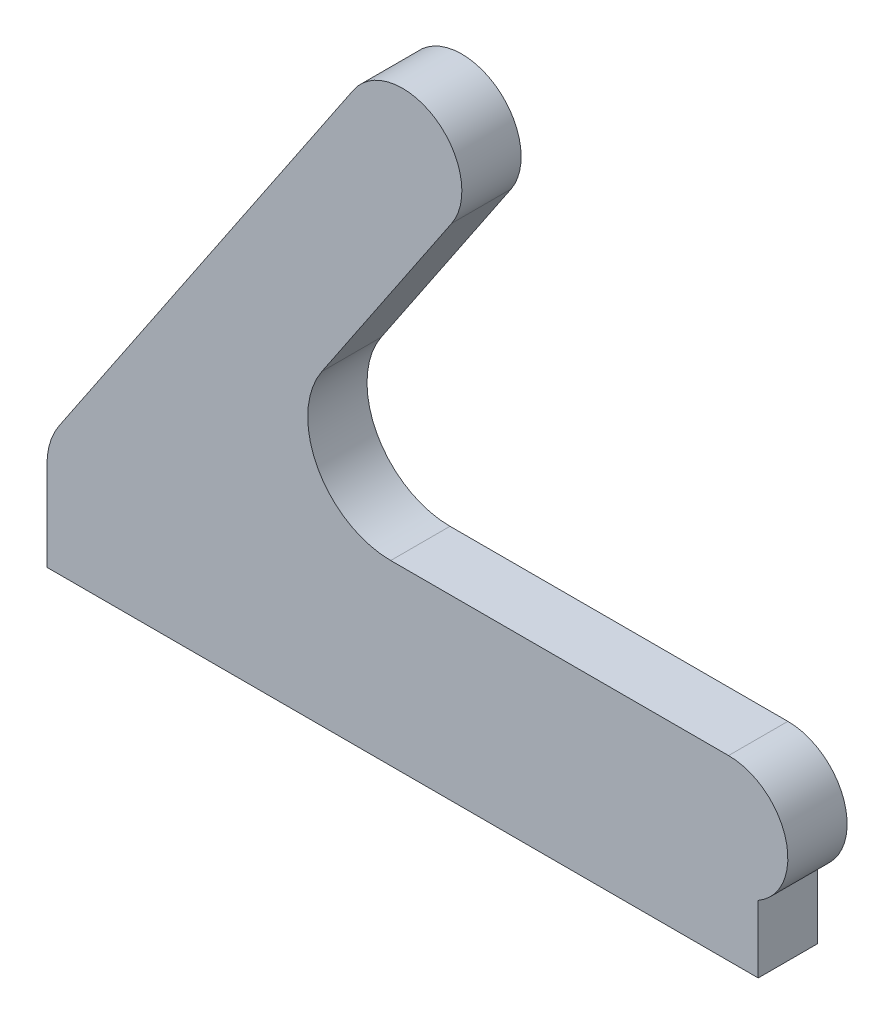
ISO-10303-21;
HEADER;
FILE_DESCRIPTION(('STEP AP214'),'2;1');
FILE_NAME('part.step','',(''),(''),'','','');
FILE_SCHEMA(('AUTOMOTIVE_DESIGN { 1 0 10303 214 1 1 1 1 }'));
ENDSEC;
DATA;
#1=APPLICATION_CONTEXT('core data for automotive mechanical design processes');
#2=APPLICATION_PROTOCOL_DEFINITION('international standard','automotive_design',2000,#1);
#3=PRODUCT_CONTEXT('',#1,'mechanical');
#4=PRODUCT('Part','Part','',(#3));
#5=PRODUCT_RELATED_PRODUCT_CATEGORY('part','',(#4));
#6=PRODUCT_DEFINITION_FORMATION('','',#4);
#7=PRODUCT_DEFINITION_CONTEXT('part definition',#1,'design');
#8=PRODUCT_DEFINITION('design','',#6,#7);
#9=PRODUCT_DEFINITION_SHAPE('','',#8);
#10=(LENGTH_UNIT() NAMED_UNIT(*) SI_UNIT(.MILLI.,.METRE.));
#11=(NAMED_UNIT(*) PLANE_ANGLE_UNIT() SI_UNIT($,.RADIAN.));
#12=(NAMED_UNIT(*) SI_UNIT($,.STERADIAN.) SOLID_ANGLE_UNIT());
#13=UNCERTAINTY_MEASURE_WITH_UNIT(LENGTH_MEASURE(1.E-05),#10,'distance_accuracy_value','');
#14=(GEOMETRIC_REPRESENTATION_CONTEXT(3) GLOBAL_UNCERTAINTY_ASSIGNED_CONTEXT((#13)) GLOBAL_UNIT_ASSIGNED_CONTEXT((#10,
#11,#12)) REPRESENTATION_CONTEXT('',''));
#15=CARTESIAN_POINT('',(0.,0.,0.));
#16=DIRECTION('',(0.,0.,1.));
#17=DIRECTION('',(1.,0.,0.));
#18=AXIS2_PLACEMENT_3D('',#15,#16,#17);
#19=CARTESIAN_POINT('',(0.,0.,10.));
#20=DIRECTION('',(1.,0.,0.));
#21=DIRECTION('',(0.,0.,-1.));
#22=AXIS2_PLACEMENT_3D('',#19,#20,#21);
#23=PLANE('',#22);
#24=DIRECTION('',(0.,-1.,0.));
#25=VECTOR('',#24,1.);
#26=CARTESIAN_POINT('',(0.,0.,0.));
#27=LINE('',#26,#25);
#28=CARTESIAN_POINT('',(0.,15.,0.));
#29=VERTEX_POINT('',#28);
#30=CARTESIAN_POINT('',(0.,0.,0.));
#31=VERTEX_POINT('',#30);
#32=EDGE_CURVE('E141',#29,#31,#27,.T.);
#33=ORIENTED_EDGE('',*,*,#32,.T.);
#34=DIRECTION('',(0.,0.,-1.));
#35=VECTOR('',#34,1.);
#36=CARTESIAN_POINT('',(0.,0.,10.));
#37=LINE('',#36,#35);
#38=CARTESIAN_POINT('',(0.,0.,10.));
#39=VERTEX_POINT('',#38);
#40=EDGE_CURVE('E11',#39,#31,#37,.T.);
#41=ORIENTED_EDGE('',*,*,#40,.F.);
#42=DIRECTION('',(0.,-1.,0.));
#43=VECTOR('',#42,1.);
#44=CARTESIAN_POINT('',(0.,0.,10.));
#45=LINE('',#44,#43);
#46=CARTESIAN_POINT('',(0.,15.,10.));
#47=VERTEX_POINT('',#46);
#48=EDGE_CURVE('E159',#47,#39,#45,.T.);
#49=ORIENTED_EDGE('',*,*,#48,.F.);
#50=DIRECTION('',(0.,0.,-1.));
#51=VECTOR('',#50,1.);
#52=CARTESIAN_POINT('',(0.,15.,10.));
#53=LINE('',#52,#51);
#54=EDGE_CURVE('E137',#47,#29,#53,.T.);
#55=ORIENTED_EDGE('',*,*,#54,.T.);
#56=EDGE_LOOP('',(#33,#41,#49,#55));
#57=FACE_BOUND('',#56,.T.);
#58=ADVANCED_FACE('F33',(#57),#23,.F.);
#59=CARTESIAN_POINT('',(0.,0.,10.));
#60=DIRECTION('',(0.,1.,0.));
#61=DIRECTION('',(0.,0.,1.));
#62=AXIS2_PLACEMENT_3D('',#59,#60,#61);
#63=PLANE('',#62);
#64=DIRECTION('',(1.,0.,0.));
#65=VECTOR('',#64,1.);
#66=CARTESIAN_POINT('',(0.,0.,0.));
#67=LINE('',#66,#65);
#68=CARTESIAN_POINT('',(120.,0.,0.));
#69=VERTEX_POINT('',#68);
#70=EDGE_CURVE('E144',#31,#69,#67,.T.);
#71=ORIENTED_EDGE('',*,*,#70,.T.);
#72=DIRECTION('',(0.,0.,-1.));
#73=VECTOR('',#72,1.);
#74=CARTESIAN_POINT('',(120.,0.,10.));
#75=LINE('',#74,#73);
#76=CARTESIAN_POINT('',(120.,0.,10.));
#77=VERTEX_POINT('',#76);
#78=EDGE_CURVE('E41',#77,#69,#75,.T.);
#79=ORIENTED_EDGE('',*,*,#78,.F.);
#80=DIRECTION('',(1.,0.,0.));
#81=VECTOR('',#80,1.);
#82=CARTESIAN_POINT('',(0.,0.,10.));
#83=LINE('',#82,#81);
#84=EDGE_CURVE('E98',#39,#77,#83,.T.);
#85=ORIENTED_EDGE('',*,*,#84,.F.);
#86=ORIENTED_EDGE('',*,*,#40,.T.);
#87=EDGE_LOOP('',(#71,#79,#85,#86));
#88=FACE_BOUND('',#87,.T.);
#89=ADVANCED_FACE('F208',(#88),#63,.F.);
#90=CARTESIAN_POINT('',(120.,0.,10.));
#91=DIRECTION('',(-1.,0.,0.));
#92=DIRECTION('',(0.,0.,1.));
#93=AXIS2_PLACEMENT_3D('',#90,#91,#92);
#94=PLANE('',#93);
#95=DIRECTION('',(0.,1.,0.));
#96=VECTOR('',#95,1.);
#97=CARTESIAN_POINT('',(120.,0.,0.));
#98=LINE('',#97,#96);
#99=CARTESIAN_POINT('',(120.,11.3397459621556,0.));
#100=VERTEX_POINT('',#99);
#101=EDGE_CURVE('E146',#69,#100,#98,.T.);
#102=ORIENTED_EDGE('',*,*,#101,.T.);
#103=DIRECTION('',(0.,0.,-1.));
#104=VECTOR('',#103,1.);
#105=CARTESIAN_POINT('',(120.,11.3397459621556,10.));
#106=LINE('',#105,#104);
#107=CARTESIAN_POINT('',(120.,11.3397459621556,10.));
#108=VERTEX_POINT('',#107);
#109=EDGE_CURVE('E172',#108,#100,#106,.T.);
#110=ORIENTED_EDGE('',*,*,#109,.F.);
#111=DIRECTION('',(0.,1.,0.));
#112=VECTOR('',#111,1.);
#113=CARTESIAN_POINT('',(120.,0.,10.));
#114=LINE('',#113,#112);
#115=EDGE_CURVE('E180',#77,#108,#114,.T.);
#116=ORIENTED_EDGE('',*,*,#115,.F.);
#117=ORIENTED_EDGE('',*,*,#78,.T.);
#118=EDGE_LOOP('',(#102,#110,#116,#117));
#119=FACE_BOUND('',#118,.T.);
#120=ADVANCED_FACE('F178',(#119),#94,.F.);
#121=CARTESIAN_POINT('',(115.,20.,10.));
#122=DIRECTION('',(0.,0.,-1.));
#123=DIRECTION('',(-1.,0.,0.));
#124=AXIS2_PLACEMENT_3D('',#121,#122,#123);
#125=CYLINDRICAL_SURFACE('',#124,10.);
#126=CARTESIAN_POINT('',(115.,20.,0.));
#127=DIRECTION('',(0.,0.,1.));
#128=DIRECTION('',(1.,0.,0.));
#129=AXIS2_PLACEMENT_3D('',#126,#127,#128);
#130=CIRCLE('',#129,10.);
#131=CARTESIAN_POINT('',(115.,30.,0.));
#132=VERTEX_POINT('',#131);
#133=EDGE_CURVE('E148',#100,#132,#130,.T.);
#134=ORIENTED_EDGE('',*,*,#133,.T.);
#135=DIRECTION('',(0.,0.,-1.));
#136=VECTOR('',#135,1.);
#137=CARTESIAN_POINT('',(115.,30.,10.));
#138=LINE('',#137,#136);
#139=CARTESIAN_POINT('',(115.,30.,10.));
#140=VERTEX_POINT('',#139);
#141=EDGE_CURVE('E169',#140,#132,#138,.T.);
#142=ORIENTED_EDGE('',*,*,#141,.F.);
#143=CARTESIAN_POINT('',(115.,20.,10.));
#144=DIRECTION('',(0.,0.,1.));
#145=DIRECTION('',(1.,0.,0.));
#146=AXIS2_PLACEMENT_3D('',#143,#144,#145);
#147=CIRCLE('',#146,10.);
#148=EDGE_CURVE('E198',#108,#140,#147,.T.);
#149=ORIENTED_EDGE('',*,*,#148,.F.);
#150=ORIENTED_EDGE('',*,*,#109,.T.);
#151=EDGE_LOOP('',(#134,#142,#149,#150));
#152=FACE_BOUND('',#151,.T.);
#153=ADVANCED_FACE('F189',(#152),#125,.T.);
#154=CARTESIAN_POINT('',(115.,30.,10.));
#155=DIRECTION('',(0.,-1.,0.));
#156=DIRECTION('',(1.,0.,0.));
#157=AXIS2_PLACEMENT_3D('',#154,#155,#156);
#158=PLANE('',#157);
#159=DIRECTION('',(-1.,0.,0.));
#160=VECTOR('',#159,1.);
#161=CARTESIAN_POINT('',(115.,30.,0.));
#162=LINE('',#161,#160);
#163=CARTESIAN_POINT('',(57.9993554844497,30.,0.));
#164=VERTEX_POINT('',#163);
#165=EDGE_CURVE('E150',#132,#164,#162,.T.);
#166=ORIENTED_EDGE('',*,*,#165,.T.);
#167=DIRECTION('',(0.,0.,-1.));
#168=VECTOR('',#167,1.);
#169=CARTESIAN_POINT('',(57.9993554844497,30.,10.));
#170=LINE('',#169,#168);
#171=CARTESIAN_POINT('',(57.9993554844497,30.,10.));
#172=VERTEX_POINT('',#171);
#173=EDGE_CURVE('E166',#172,#164,#170,.T.);
#174=ORIENTED_EDGE('',*,*,#173,.F.);
#175=DIRECTION('',(-1.,0.,0.));
#176=VECTOR('',#175,1.);
#177=CARTESIAN_POINT('',(115.,30.,10.));
#178=LINE('',#177,#176);
#179=EDGE_CURVE('E195',#140,#172,#178,.T.);
#180=ORIENTED_EDGE('',*,*,#179,.F.);
#181=ORIENTED_EDGE('',*,*,#141,.T.);
#182=EDGE_LOOP('',(#166,#174,#180,#181));
#183=FACE_BOUND('',#182,.T.);
#184=ADVANCED_FACE('F193',(#183),#158,.F.);
#185=CARTESIAN_POINT('',(57.9993554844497,44.,10.));
#186=DIRECTION('',(0.,0.,-1.));
#187=DIRECTION('',(-1.,0.,0.));
#188=AXIS2_PLACEMENT_3D('',#185,#186,#187);
#189=CYLINDRICAL_SURFACE('',#188,14.);
#190=CARTESIAN_POINT('',(57.9993554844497,44.,0.));
#191=DIRECTION('',(0.,0.,-1.));
#192=DIRECTION('',(1.,0.,0.));
#193=AXIS2_PLACEMENT_3D('',#190,#191,#192);
#194=CIRCLE('',#193,14.);
#195=CARTESIAN_POINT('',(46.380034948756,51.8096984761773,0.));
#196=VERTEX_POINT('',#195);
#197=EDGE_CURVE('E152',#164,#196,#194,.T.);
#198=ORIENTED_EDGE('',*,*,#197,.T.);
#199=DIRECTION('',(0.,0.,-1.));
#200=VECTOR('',#199,1.);
#201=CARTESIAN_POINT('',(46.380034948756,51.8096984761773,10.));
#202=LINE('',#201,#200);
#203=CARTESIAN_POINT('',(46.380034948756,51.8096984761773,10.));
#204=VERTEX_POINT('',#203);
#205=EDGE_CURVE('E163',#204,#196,#202,.T.);
#206=ORIENTED_EDGE('',*,*,#205,.F.);
#207=CARTESIAN_POINT('',(57.9993554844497,44.,10.));
#208=DIRECTION('',(0.,0.,-1.));
#209=DIRECTION('',(1.,0.,0.));
#210=AXIS2_PLACEMENT_3D('',#207,#208,#209);
#211=CIRCLE('',#210,14.);
#212=EDGE_CURVE('E197',#172,#204,#211,.T.);
#213=ORIENTED_EDGE('',*,*,#212,.F.);
#214=ORIENTED_EDGE('',*,*,#173,.T.);
#215=EDGE_LOOP('',(#198,#206,#213,#214));
#216=FACE_BOUND('',#215,.T.);
#217=ADVANCED_FACE('F220',(#216),#189,.F.);
#218=CARTESIAN_POINT('',(68.2995146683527,84.4216439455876,10.));
#219=DIRECTION('',(-0.829951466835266,0.557835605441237,0.));
#220=DIRECTION('',(-0.557835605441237,-0.829951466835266,0.));
#221=AXIS2_PLACEMENT_3D('',#218,#219,#220);
#222=PLANE('',#221);
#223=DIRECTION('',(0.557835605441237,0.829951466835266,0.));
#224=VECTOR('',#223,1.);
#225=CARTESIAN_POINT('',(68.2995146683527,84.4216439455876,0.));
#226=LINE('',#225,#224);
#227=CARTESIAN_POINT('',(68.2995146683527,84.4216439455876,0.));
#228=VERTEX_POINT('',#227);
#229=EDGE_CURVE('E154',#196,#228,#226,.T.);
#230=ORIENTED_EDGE('',*,*,#229,.T.);
#231=DIRECTION('',(0.,0.,-1.));
#232=VECTOR('',#231,1.);
#233=CARTESIAN_POINT('',(68.2995146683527,84.4216439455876,10.));
#234=LINE('',#233,#232);
#235=CARTESIAN_POINT('',(68.2995146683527,84.4216439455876,10.));
#236=VERTEX_POINT('',#235);
#237=EDGE_CURVE('E132',#236,#228,#234,.T.);
#238=ORIENTED_EDGE('',*,*,#237,.F.);
#239=DIRECTION('',(0.557835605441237,0.829951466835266,0.));
#240=VECTOR('',#239,1.);
#241=CARTESIAN_POINT('',(68.2995146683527,84.4216439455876,10.));
#242=LINE('',#241,#240);
#243=EDGE_CURVE('E123',#204,#236,#242,.T.);
#244=ORIENTED_EDGE('',*,*,#243,.F.);
#245=ORIENTED_EDGE('',*,*,#205,.T.);
#246=EDGE_LOOP('',(#230,#238,#244,#245));
#247=FACE_BOUND('',#246,.T.);
#248=ADVANCED_FACE('F223',(#247),#222,.F.);
#249=CARTESIAN_POINT('',(60.,90.,10.));
#250=DIRECTION('',(0.,0.,-1.));
#251=DIRECTION('',(-1.,0.,0.));
#252=AXIS2_PLACEMENT_3D('',#249,#250,#251);
#253=CYLINDRICAL_SURFACE('',#252,10.);
#254=CARTESIAN_POINT('',(60.,90.,0.));
#255=DIRECTION('',(0.,0.,1.));
#256=DIRECTION('',(-1.,0.,0.));
#257=AXIS2_PLACEMENT_3D('',#254,#255,#256);
#258=CIRCLE('',#257,10.);
#259=CARTESIAN_POINT('',(51.7004853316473,95.5783560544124,0.));
#260=VERTEX_POINT('',#259);
#261=EDGE_CURVE('E131',#228,#260,#258,.T.);
#262=ORIENTED_EDGE('',*,*,#261,.T.);
#263=DIRECTION('',(0.,0.,-1.));
#264=VECTOR('',#263,1.);
#265=CARTESIAN_POINT('',(51.7004853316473,95.5783560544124,10.));
#266=LINE('',#265,#264);
#267=CARTESIAN_POINT('',(51.7004853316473,95.5783560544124,10.));
#268=VERTEX_POINT('',#267);
#269=EDGE_CURVE('E128',#268,#260,#266,.T.);
#270=ORIENTED_EDGE('',*,*,#269,.F.);
#271=CARTESIAN_POINT('',(60.,90.,10.));
#272=DIRECTION('',(0.,0.,1.));
#273=DIRECTION('',(-1.,0.,0.));
#274=AXIS2_PLACEMENT_3D('',#271,#272,#273);
#275=CIRCLE('',#274,10.);
#276=EDGE_CURVE('E117',#236,#268,#275,.T.);
#277=ORIENTED_EDGE('',*,*,#276,.F.);
#278=ORIENTED_EDGE('',*,*,#237,.T.);
#279=EDGE_LOOP('',(#262,#270,#277,#278));
#280=FACE_BOUND('',#279,.T.);
#281=ADVANCED_FACE('F129',(#280),#253,.T.);
#282=CARTESIAN_POINT('',(2.04058239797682,21.6940272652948,10.));
#283=DIRECTION('',(0.829951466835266,-0.557835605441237,0.));
#284=DIRECTION('',(0.557835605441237,0.829951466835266,0.));
#285=AXIS2_PLACEMENT_3D('',#282,#283,#284);
#286=PLANE('',#285);
#287=DIRECTION('',(-0.557835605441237,-0.829951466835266,0.));
#288=VECTOR('',#287,1.);
#289=CARTESIAN_POINT('',(2.04058239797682,21.6940272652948,0.));
#290=LINE('',#289,#288);
#291=CARTESIAN_POINT('',(2.04058239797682,21.6940272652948,0.));
#292=VERTEX_POINT('',#291);
#293=EDGE_CURVE('E84',#260,#292,#290,.T.);
#294=ORIENTED_EDGE('',*,*,#293,.T.);
#295=DIRECTION('',(0.,0.,-1.));
#296=VECTOR('',#295,1.);
#297=CARTESIAN_POINT('',(2.04058239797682,21.6940272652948,10.));
#298=LINE('',#297,#296);
#299=CARTESIAN_POINT('',(2.04058239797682,21.6940272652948,10.));
#300=VERTEX_POINT('',#299);
#301=EDGE_CURVE('E133',#300,#292,#298,.T.);
#302=ORIENTED_EDGE('',*,*,#301,.F.);
#303=DIRECTION('',(-0.557835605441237,-0.829951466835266,0.));
#304=VECTOR('',#303,1.);
#305=CARTESIAN_POINT('',(2.04058239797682,21.6940272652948,10.));
#306=LINE('',#305,#304);
#307=EDGE_CURVE('E121',#268,#300,#306,.T.);
#308=ORIENTED_EDGE('',*,*,#307,.F.);
#309=ORIENTED_EDGE('',*,*,#269,.T.);
#310=EDGE_LOOP('',(#294,#302,#308,#309));
#311=FACE_BOUND('',#310,.T.);
#312=ADVANCED_FACE('F135',(#311),#286,.F.);
#313=CARTESIAN_POINT('',(12.,15.,10.));
#314=DIRECTION('',(0.,0.,-1.));
#315=DIRECTION('',(-1.,0.,0.));
#316=AXIS2_PLACEMENT_3D('',#313,#314,#315);
#317=CYLINDRICAL_SURFACE('',#316,12.);
#318=CARTESIAN_POINT('',(12.,15.,0.));
#319=DIRECTION('',(0.,0.,1.));
#320=DIRECTION('',(-1.,0.,0.));
#321=AXIS2_PLACEMENT_3D('',#318,#319,#320);
#322=CIRCLE('',#321,12.);
#323=EDGE_CURVE('E90',#292,#29,#322,.T.);
#324=ORIENTED_EDGE('',*,*,#323,.T.);
#325=ORIENTED_EDGE('',*,*,#54,.F.);
#326=CARTESIAN_POINT('',(12.,15.,10.));
#327=DIRECTION('',(0.,0.,1.));
#328=DIRECTION('',(-1.,0.,0.));
#329=AXIS2_PLACEMENT_3D('',#326,#327,#328);
#330=CIRCLE('',#329,12.);
#331=EDGE_CURVE('E49',#300,#47,#330,.T.);
#332=ORIENTED_EDGE('',*,*,#331,.F.);
#333=ORIENTED_EDGE('',*,*,#301,.T.);
#334=EDGE_LOOP('',(#324,#325,#332,#333));
#335=FACE_BOUND('',#334,.T.);
#336=ADVANCED_FACE('F232',(#335),#317,.T.);
#337=CARTESIAN_POINT('',(12.,15.,10.));
#338=DIRECTION('',(0.,0.,-1.));
#339=DIRECTION('',(-1.,0.,0.));
#340=AXIS2_PLACEMENT_3D('',#337,#338,#339);
#341=PLANE('',#340);
#342=ORIENTED_EDGE('',*,*,#48,.T.);
#343=ORIENTED_EDGE('',*,*,#84,.T.);
#344=ORIENTED_EDGE('',*,*,#115,.T.);
#345=ORIENTED_EDGE('',*,*,#148,.T.);
#346=ORIENTED_EDGE('',*,*,#179,.T.);
#347=ORIENTED_EDGE('',*,*,#212,.T.);
#348=ORIENTED_EDGE('',*,*,#243,.T.);
#349=ORIENTED_EDGE('',*,*,#276,.T.);
#350=ORIENTED_EDGE('',*,*,#307,.T.);
#351=ORIENTED_EDGE('',*,*,#331,.T.);
#352=EDGE_LOOP('',(#342,#343,#344,#345,#346,#347,#348,#349,#350,#351));
#353=FACE_BOUND('',#352,.T.);
#354=ADVANCED_FACE('F119',(#353),#341,.F.);
#355=CARTESIAN_POINT('',(12.,15.,0.));
#356=DIRECTION('',(0.,0.,-1.));
#357=DIRECTION('',(-1.,0.,0.));
#358=AXIS2_PLACEMENT_3D('',#355,#356,#357);
#359=PLANE('',#358);
#360=ORIENTED_EDGE('',*,*,#32,.F.);
#361=ORIENTED_EDGE('',*,*,#323,.F.);
#362=ORIENTED_EDGE('',*,*,#293,.F.);
#363=ORIENTED_EDGE('',*,*,#261,.F.);
#364=ORIENTED_EDGE('',*,*,#229,.F.);
#365=ORIENTED_EDGE('',*,*,#197,.F.);
#366=ORIENTED_EDGE('',*,*,#165,.F.);
#367=ORIENTED_EDGE('',*,*,#133,.F.);
#368=ORIENTED_EDGE('',*,*,#101,.F.);
#369=ORIENTED_EDGE('',*,*,#70,.F.);
#370=EDGE_LOOP('',(#360,#361,#362,#363,#364,#365,#366,#367,#368,#369));
#371=FACE_BOUND('',#370,.T.);
#372=ADVANCED_FACE('F184',(#371),#359,.T.);
#373=CLOSED_SHELL('',(#58,#89,#120,#153,#184,#217,#248,#281,#312,#336,#354,#372));
#374=MANIFOLD_SOLID_BREP('B2',#373);
#375=ADVANCED_BREP_SHAPE_REPRESENTATION('',(#18,#374),#14);
#376=SHAPE_DEFINITION_REPRESENTATION(#9,#375);
ENDSEC;
END-ISO-10303-21;
